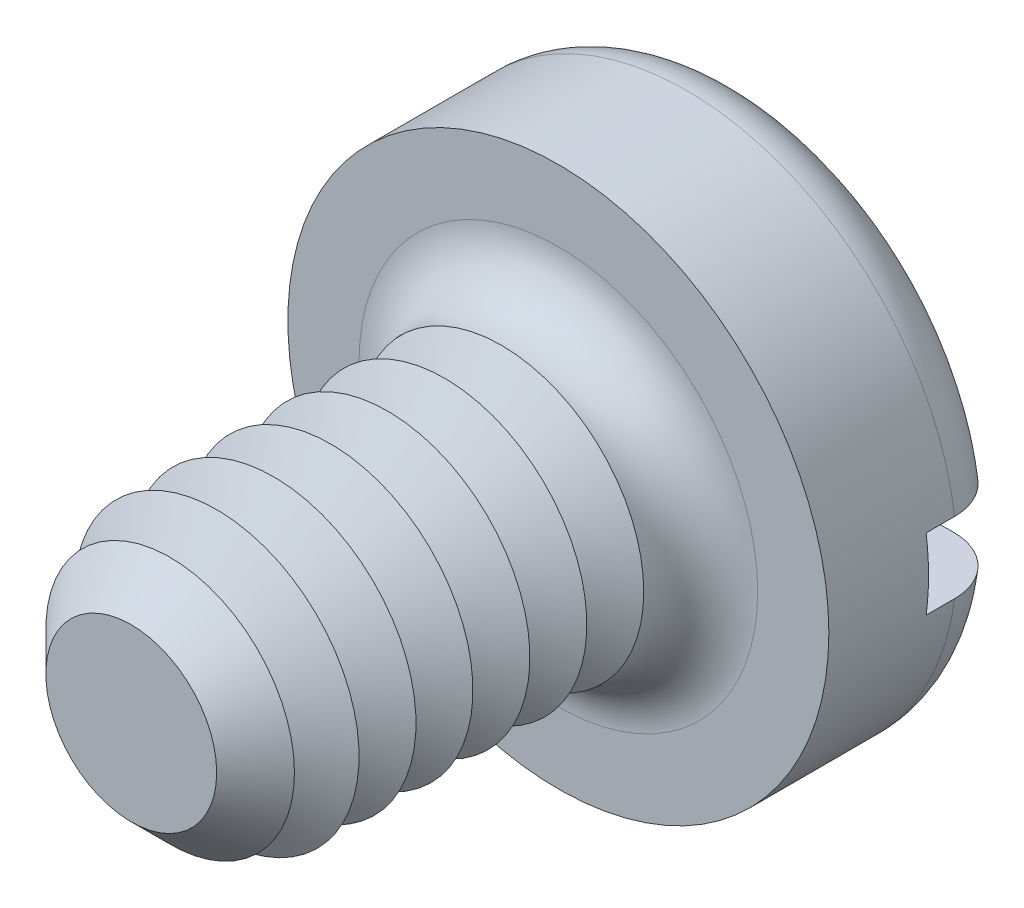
ISO-10303-21;
HEADER;
FILE_DESCRIPTION(('STEP AP214'),'2;1');
FILE_NAME('part.step','',(''),(''),'','','');
FILE_SCHEMA(('AUTOMOTIVE_DESIGN { 1 0 10303 214 1 1 1 1 }'));
ENDSEC;
DATA;
#1=APPLICATION_CONTEXT('core data for automotive mechanical design processes');
#2=APPLICATION_PROTOCOL_DEFINITION('international standard','automotive_design',2000,#1);
#3=PRODUCT_CONTEXT('',#1,'mechanical');
#4=PRODUCT('Part','Part','',(#3));
#5=PRODUCT_RELATED_PRODUCT_CATEGORY('part','',(#4));
#6=PRODUCT_DEFINITION_FORMATION('','',#4);
#7=PRODUCT_DEFINITION_CONTEXT('part definition',#1,'design');
#8=PRODUCT_DEFINITION('design','',#6,#7);
#9=PRODUCT_DEFINITION_SHAPE('','',#8);
#10=(LENGTH_UNIT() NAMED_UNIT(*) SI_UNIT(.MILLI.,.METRE.));
#11=(NAMED_UNIT(*) PLANE_ANGLE_UNIT() SI_UNIT($,.RADIAN.));
#12=(NAMED_UNIT(*) SI_UNIT($,.STERADIAN.) SOLID_ANGLE_UNIT());
#13=UNCERTAINTY_MEASURE_WITH_UNIT(LENGTH_MEASURE(1.E-05),#10,'distance_accuracy_value','');
#14=(GEOMETRIC_REPRESENTATION_CONTEXT(3) GLOBAL_UNCERTAINTY_ASSIGNED_CONTEXT((#13)) GLOBAL_UNIT_ASSIGNED_CONTEXT((#10,
#11,#12)) REPRESENTATION_CONTEXT('',''));
#15=CARTESIAN_POINT('',(0.,0.,0.));
#16=DIRECTION('',(0.,0.,1.));
#17=DIRECTION('',(1.,0.,0.));
#18=AXIS2_PLACEMENT_3D('',#15,#16,#17);
#19=CARTESIAN_POINT('',(0.,0.,-1.3));
#20=DIRECTION('',(0.,0.,1.));
#21=DIRECTION('',(1.,0.,0.));
#22=AXIS2_PLACEMENT_3D('',#19,#20,#21);
#23=PLANE('',#22);
#24=CARTESIAN_POINT('',(0.,0.,-1.3));
#25=DIRECTION('',(0.,0.,1.));
#26=DIRECTION('',(1.,0.,0.));
#27=AXIS2_PLACEMENT_3D('',#24,#25,#26);
#28=CIRCLE('',#27,1.5);
#29=CARTESIAN_POINT('',(-1.4790199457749,0.25,-1.3));
#30=VERTEX_POINT('',#29);
#31=CARTESIAN_POINT('',(1.4790199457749,0.25,-1.3));
#32=VERTEX_POINT('',#31);
#33=EDGE_CURVE('E116',#30,#32,#28,.F.);
#34=ORIENTED_EDGE('',*,*,#33,.T.);
#35=DIRECTION('',(1.,0.,0.));
#36=VECTOR('',#35,1.);
#37=CARTESIAN_POINT('',(-1.9,0.25,-1.3));
#38=LINE('',#37,#36);
#39=EDGE_CURVE('E111',#30,#32,#38,.T.);
#40=ORIENTED_EDGE('',*,*,#39,.F.);
#41=EDGE_LOOP('',(#34,#40));
#42=FACE_BOUND('',#41,.T.);
#43=ADVANCED_FACE('F39',(#42),#23,.F.);
#44=CARTESIAN_POINT('',(0.,0.,-0.9));
#45=DIRECTION('',(0.,0.,1.));
#46=DIRECTION('',(1.,0.,0.));
#47=AXIS2_PLACEMENT_3D('',#44,#45,#46);
#48=TOROIDAL_SURFACE('',#47,1.5,0.4);
#49=CARTESIAN_POINT('',(-1.8150392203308,0.25,-1.12284384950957));
#50=CARTESIAN_POINT('',(-1.80236980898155,0.25,-1.14155059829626));
#51=CARTESIAN_POINT('',(-1.78809920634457,0.25,-1.15919399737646));
#52=CARTESIAN_POINT('',(-1.75677844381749,0.25,-1.19184073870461));
#53=CARTESIAN_POINT('',(-1.73972468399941,0.25,-1.20684060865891));
#54=CARTESIAN_POINT('',(-1.70336024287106,0.25,-1.23375848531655));
#55=CARTESIAN_POINT('',(-1.68405164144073,0.25,-1.24567930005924));
#56=CARTESIAN_POINT('',(-1.64372549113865,0.25,-1.26613528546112));
#57=CARTESIAN_POINT('',(-1.6227083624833,0.25,-1.27467128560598));
#58=CARTESIAN_POINT('',(-1.57937988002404,0.25,-1.2881995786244));
#59=CARTESIAN_POINT('',(-1.55705957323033,0.25,-1.29316318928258));
#60=CARTESIAN_POINT('',(-1.51190394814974,0.25,-1.29931753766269));
#61=CARTESIAN_POINT('',(-1.48906857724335,0.25,-1.3005078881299));
#62=CARTESIAN_POINT('',(-1.4432641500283,0.25,-1.29909058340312));
#63=CARTESIAN_POINT('',(-1.42029638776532,0.25,-1.29644099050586));
#64=CARTESIAN_POINT('',(-1.37512297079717,0.25,-1.28735146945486));
#65=CARTESIAN_POINT('',(-1.3529173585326,0.25,-1.28091133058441));
#66=CARTESIAN_POINT('',(-1.30974098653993,0.25,-1.26436295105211));
#67=CARTESIAN_POINT('',(-1.28877978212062,0.25,-1.25422975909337));
#68=CARTESIAN_POINT('',(-1.24886205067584,0.25,-1.23057736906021));
#69=CARTESIAN_POINT('',(-1.22990554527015,0.25,-1.21705813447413));
#70=CARTESIAN_POINT('',(-1.19461911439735,0.25,-1.18704970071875));
#71=CARTESIAN_POINT('',(-1.17828051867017,0.25,-1.17057070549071));
#72=CARTESIAN_POINT('',(-1.14865897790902,0.25,-1.13506201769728));
#73=CARTESIAN_POINT('',(-1.13537576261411,0.25,-1.11603255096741));
#74=CARTESIAN_POINT('',(-1.11249827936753,0.25,-1.07630328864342));
#75=CARTESIAN_POINT('',(-1.10284494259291,0.25,-1.05563752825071));
#76=CARTESIAN_POINT('',(-1.08724024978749,0.25,-1.01295282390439));
#77=CARTESIAN_POINT('',(-1.08128829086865,0.25,-0.990934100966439));
#78=CARTESIAN_POINT('',(-1.07339124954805,0.25,-0.946722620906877));
#79=CARTESIAN_POINT('',(-1.07135558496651,0.25,-0.924546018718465));
#80=CARTESIAN_POINT('',(-1.07108722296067,0.25,-0.880170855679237));
#81=CARTESIAN_POINT('',(-1.07285419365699,0.25,-0.857972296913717));
#82=CARTESIAN_POINT('',(-1.0800838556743,0.25,-0.814463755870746));
#83=CARTESIAN_POINT('',(-1.08550159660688,0.25,-0.793146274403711));
#84=CARTESIAN_POINT('',(-1.09980522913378,0.25,-0.751709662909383));
#85=CARTESIAN_POINT('',(-1.10869126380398,0.25,-0.731590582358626));
#86=CARTESIAN_POINT('',(-1.12975121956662,0.25,-0.692901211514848));
#87=CARTESIAN_POINT('',(-1.14195627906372,0.25,-0.674347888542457));
#88=CARTESIAN_POINT('',(-1.1692428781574,0.25,-0.639494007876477));
#89=CARTESIAN_POINT('',(-1.18432473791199,0.25,-0.623193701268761));
#90=CARTESIAN_POINT('',(-1.21730350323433,0.25,-0.592916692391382));
#91=CARTESIAN_POINT('',(-1.23525650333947,0.25,-0.579001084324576));
#92=CARTESIAN_POINT('',(-1.27320799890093,0.25,-0.554314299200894));
#93=CARTESIAN_POINT('',(-1.2932067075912,0.25,-0.543543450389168));
#94=CARTESIAN_POINT('',(-1.33509120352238,0.25,-0.525253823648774));
#95=CARTESIAN_POINT('',(-1.35700545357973,0.25,-0.517800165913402));
#96=CARTESIAN_POINT('',(-1.401770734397,0.25,-0.506652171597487));
#97=CARTESIAN_POINT('',(-1.42462180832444,0.25,-0.502958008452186));
#98=CARTESIAN_POINT('',(-1.4707602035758,0.25,-0.499429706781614));
#99=CARTESIAN_POINT('',(-1.49404932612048,0.25,-0.499619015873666));
#100=CARTESIAN_POINT('',(-1.54026206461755,0.25,-0.50392615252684));
#101=CARTESIAN_POINT('',(-1.56318568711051,0.25,-0.508043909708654));
#102=CARTESIAN_POINT('',(-1.60788420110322,0.25,-0.520077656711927));
#103=CARTESIAN_POINT('',(-1.6296645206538,0.25,-0.527973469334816));
#104=CARTESIAN_POINT('',(-1.67156889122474,0.25,-0.547348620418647));
#105=CARTESIAN_POINT('',(-1.69169302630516,0.25,-0.558827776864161));
#106=CARTESIAN_POINT('',(-1.72948251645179,0.25,-0.584913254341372));
#107=CARTESIAN_POINT('',(-1.74717189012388,0.25,-0.599484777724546));
#108=CARTESIAN_POINT('',(-1.77981909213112,0.25,-0.63142070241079));
#109=CARTESIAN_POINT('',(-1.79477707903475,0.25,-0.648784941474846));
#110=CARTESIAN_POINT('',(-1.82136524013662,0.25,-0.685607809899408));
#111=CARTESIAN_POINT('',(-1.83303003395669,0.25,-0.705041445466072));
#112=CARTESIAN_POINT('',(-1.85289960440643,0.25,-0.745602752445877));
#113=CARTESIAN_POINT('',(-1.86110468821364,0.25,-0.76673027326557));
#114=CARTESIAN_POINT('',(-1.87375648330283,0.25,-0.809891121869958));
#115=CARTESIAN_POINT('',(-1.87823381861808,0.25,-0.831915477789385));
#116=CARTESIAN_POINT('',(-1.88341152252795,0.25,-0.87640983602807));
#117=CARTESIAN_POINT('',(-1.88411103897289,0.25,-0.898879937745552));
#118=CARTESIAN_POINT('',(-1.88171559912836,0.25,-0.943534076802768));
#119=CARTESIAN_POINT('',(-1.87863413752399,0.25,-0.965718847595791));
#120=CARTESIAN_POINT('',(-1.86879153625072,0.25,-1.00923650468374));
#121=CARTESIAN_POINT('',(-1.86203494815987,0.25,-1.03057040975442));
#122=CARTESIAN_POINT('',(-1.84837477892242,0.25,-1.06373797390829));
#123=CARTESIAN_POINT('',(-1.84255723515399,0.25,-1.07603047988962));
#124=CARTESIAN_POINT('',(-1.82969924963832,0.25,-1.09995814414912));
#125=CARTESIAN_POINT('',(-1.82265881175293,0.25,-1.11159330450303));
#126=CARTESIAN_POINT('',(-1.8150392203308,0.25,-1.12284384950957));
#127=B_SPLINE_CURVE_WITH_KNOTS('',3,(#49,#50,#51,#52,#53,#54,#55,#56,#57,#58,#59,#60,#61,#62,
#63,#64,#65,#66,#67,#68,#69,#70,#71,#72,#73,#74,#75,#76,#77,#78,#79,#80,#81,#82,#83,#84,#85,#86,
#87,#88,#89,#90,#91,#92,#93,#94,#95,#96,#97,#98,#99,#100,#101,#102,#103,#104,#105,#106,#107,
#108,#109,#110,#111,#112,#113,#114,#115,#116,#117,#118,#119,#120,#121,#122,#123,#124,#125,#126),
.UNSPECIFIED.,.T.,.F.,(4,2,2,2,2,2,2,2,2,2,2,2,2,2,2,2,2,2,2,2,2,2,2,2,2,2,2,2,2,2,2,2,2,2,2,2,
2,2,4),(0.,0.0677296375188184,0.135547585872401,0.203303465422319,0.27104273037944,
0.339319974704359,0.407604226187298,0.47663988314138,0.545679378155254,0.615194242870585,
0.684709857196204,0.753990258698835,0.82326452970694,0.891356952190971,0.959438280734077,
1.02592503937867,1.0924059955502,1.15808300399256,1.2237627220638,1.29008126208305,
1.35640718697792,1.4242376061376,1.49207510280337,1.5611911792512,1.63031044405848,
1.69984715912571,1.76938262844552,1.8385508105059,1.90771547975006,1.97613962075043,
2.04455978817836,2.11223135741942,2.17989691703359,2.24700094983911,2.31412011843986,
2.38100042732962,2.44779809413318,2.48853193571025,2.52926564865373),.UNSPECIFIED.);
#128=CARTESIAN_POINT('',(-1.88348082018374,0.25,-0.9));
#129=VERTEX_POINT('',#128);
#130=EDGE_CURVE('E232',#129,#30,#127,.T.);
#131=ORIENTED_EDGE('',*,*,#130,.F.);
#132=CARTESIAN_POINT('',(0.,0.,-0.9));
#133=DIRECTION('',(0.,0.,1.));
#134=DIRECTION('',(1.,0.,0.));
#135=AXIS2_PLACEMENT_3D('',#132,#133,#134);
#136=CIRCLE('',#135,1.9);
#137=CARTESIAN_POINT('',(1.88348082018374,0.25,-0.9));
#138=VERTEX_POINT('',#137);
#139=EDGE_CURVE('E124',#138,#129,#136,.T.);
#140=ORIENTED_EDGE('',*,*,#139,.F.);
#141=CARTESIAN_POINT('',(1.11362660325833,0.25,-1.07710243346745));
#142=CARTESIAN_POINT('',(1.12388366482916,0.25,-1.09736755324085));
#143=CARTESIAN_POINT('',(1.13589127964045,0.25,-1.11676768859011));
#144=CARTESIAN_POINT('',(1.16301945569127,0.25,-1.15328107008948));
#145=CARTESIAN_POINT('',(1.17814463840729,0.25,-1.17039085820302));
#146=CARTESIAN_POINT('',(1.21101661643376,0.25,-1.20182395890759));
#147=CARTESIAN_POINT('',(1.22875976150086,0.25,-1.21615108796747));
#148=CARTESIAN_POINT('',(1.26636392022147,0.25,-1.24166932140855));
#149=CARTESIAN_POINT('',(1.28622436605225,0.25,-1.25286126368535));
#150=CARTESIAN_POINT('',(1.32781377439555,0.25,-1.27196191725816));
#151=CARTESIAN_POINT('',(1.34956550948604,0.25,-1.27982107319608));
#152=CARTESIAN_POINT('',(1.39407620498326,0.25,-1.29180513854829));
#153=CARTESIAN_POINT('',(1.41683526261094,0.25,-1.29592968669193));
#154=CARTESIAN_POINT('',(1.46288034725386,0.25,-1.3003367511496));
#155=CARTESIAN_POINT('',(1.48616890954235,0.25,-1.30059287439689));
#156=CARTESIAN_POINT('',(1.53245605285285,0.25,-1.29717239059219));
#157=CARTESIAN_POINT('',(1.55545463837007,0.25,-1.29349584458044));
#158=CARTESIAN_POINT('',(1.60038828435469,0.25,-1.28232271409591));
#159=CARTESIAN_POINT('',(1.62232790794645,0.25,-1.27484449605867));
#160=CARTESIAN_POINT('',(1.66461970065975,0.25,-1.25627203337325));
#161=CARTESIAN_POINT('',(1.68497195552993,0.25,-1.24517798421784));
#162=CARTESIAN_POINT('',(1.72328060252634,0.25,-1.21981269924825));
#163=CARTESIAN_POINT('',(1.74126001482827,0.25,-1.2055762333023));
#164=CARTESIAN_POINT('',(1.77453973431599,0.25,-1.17425606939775));
#165=CARTESIAN_POINT('',(1.78984019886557,0.25,-1.1571725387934));
#166=CARTESIAN_POINT('',(1.81715014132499,0.25,-1.12084732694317));
#167=CARTESIAN_POINT('',(1.82919410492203,0.25,-1.10163156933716));
#168=CARTESIAN_POINT('',(1.84985315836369,0.25,-1.06143759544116));
#169=CARTESIAN_POINT('',(1.85846842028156,0.25,-1.04045946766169));
#170=CARTESIAN_POINT('',(1.87195437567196,0.25,-0.997526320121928));
#171=CARTESIAN_POINT('',(1.87685590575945,0.25,-0.975580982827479));
#172=CARTESIAN_POINT('',(1.88288741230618,0.25,-0.931178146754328));
#173=CARTESIAN_POINT('',(1.88401750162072,0.25,-0.908720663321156));
#174=CARTESIAN_POINT('',(1.88247598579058,0.25,-0.864033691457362));
#175=CARTESIAN_POINT('',(1.87982069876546,0.25,-0.841803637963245));
#176=CARTESIAN_POINT('',(1.87081646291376,0.25,-0.798104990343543));
#177=CARTESIAN_POINT('',(1.86446754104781,0.25,-0.776636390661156));
#178=CARTESIAN_POINT('',(1.84826063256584,0.25,-0.735060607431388));
#179=CARTESIAN_POINT('',(1.83840161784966,0.25,-0.714953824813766));
#180=CARTESIAN_POINT('',(1.81546327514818,0.25,-0.676670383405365));
#181=CARTESIAN_POINT('',(1.80238389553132,0.25,-0.658493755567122));
#182=CARTESIAN_POINT('',(1.77331327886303,0.25,-0.62448916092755));
#183=CARTESIAN_POINT('',(1.75730833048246,0.25,-0.608672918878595));
#184=CARTESIAN_POINT('',(1.72289038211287,0.25,-0.579924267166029));
#185=CARTESIAN_POINT('',(1.70447729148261,0.25,-0.566991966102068));
#186=CARTESIAN_POINT('',(1.66559643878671,0.25,-0.544254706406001));
#187=CARTESIAN_POINT('',(1.64511218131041,0.25,-0.53447796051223));
#188=CARTESIAN_POINT('',(1.60280554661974,0.25,-0.518459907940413));
#189=CARTESIAN_POINT('',(1.58098309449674,0.25,-0.512218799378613));
#190=CARTESIAN_POINT('',(1.53636184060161,0.25,-0.503375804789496));
#191=CARTESIAN_POINT('',(1.51355490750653,0.25,-0.500814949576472));
#192=CARTESIAN_POINT('',(1.46783245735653,0.25,-0.499516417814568));
#193=CARTESIAN_POINT('',(1.44491693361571,0.25,-0.500778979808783));
#194=CARTESIAN_POINT('',(1.39937748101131,0.25,-0.50711284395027));
#195=CARTESIAN_POINT('',(1.37675897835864,0.25,-0.512223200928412));
#196=CARTESIAN_POINT('',(1.33269286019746,0.25,-0.526151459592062));
#197=CARTESIAN_POINT('',(1.31124530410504,0.25,-0.534969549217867));
#198=CARTESIAN_POINT('',(1.27004097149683,0.25,-0.556118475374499));
#199=CARTESIAN_POINT('',(1.25029179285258,0.25,-0.568464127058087));
#200=CARTESIAN_POINT('',(1.21316554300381,0.25,-0.59631968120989));
#201=CARTESIAN_POINT('',(1.19578844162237,0.25,-0.611829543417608));
#202=CARTESIAN_POINT('',(1.16406059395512,0.25,-0.645459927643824));
#203=CARTESIAN_POINT('',(1.14968747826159,0.25,-0.663559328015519));
#204=CARTESIAN_POINT('',(1.12425968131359,0.25,-0.70195566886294));
#205=CARTESIAN_POINT('',(1.11320445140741,0.25,-0.722252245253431));
#206=CARTESIAN_POINT('',(1.09497726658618,0.25,-0.764020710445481));
#207=CARTESIAN_POINT('',(1.08772970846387,0.25,-0.785459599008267));
#208=CARTESIAN_POINT('',(1.07702618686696,0.25,-0.829269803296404));
#209=CARTESIAN_POINT('',(1.07357062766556,0.25,-0.851641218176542));
#210=CARTESIAN_POINT('',(1.07060826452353,0.25,-0.896160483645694));
#211=CARTESIAN_POINT('',(1.07101876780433,0.25,-0.918302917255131));
#212=CARTESIAN_POINT('',(1.07557730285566,0.25,-0.962179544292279));
#213=CARTESIAN_POINT('',(1.07972048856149,0.25,-0.983914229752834));
#214=CARTESIAN_POINT('',(1.08912066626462,0.25,-1.01754924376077));
#215=CARTESIAN_POINT('',(1.09320341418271,0.25,-1.02979035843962));
#216=CARTESIAN_POINT('',(1.10254493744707,0.25,-1.05381470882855));
#217=CARTESIAN_POINT('',(1.10780368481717,0.25,-1.06559795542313));
#218=CARTESIAN_POINT('',(1.11362660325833,0.25,-1.07710243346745));
#219=B_SPLINE_CURVE_WITH_KNOTS('',3,(#141,#142,#143,#144,#145,#146,#147,#148,#149,#150,#151,
#152,#153,#154,#155,#156,#157,#158,#159,#160,#161,#162,#163,#164,#165,#166,#167,#168,#169,#170,
#171,#172,#173,#174,#175,#176,#177,#178,#179,#180,#181,#182,#183,#184,#185,#186,#187,#188,#189,
#190,#191,#192,#193,#194,#195,#196,#197,#198,#199,#200,#201,#202,#203,#204,#205,#206,#207,#208,
#209,#210,#211,#212,#213,#214,#215,#216,#217,#218),.UNSPECIFIED.,.T.,.F.,(4,2,2,2,2,2,2,2,2,2,2,
2,2,2,2,2,2,2,2,2,2,2,2,2,2,2,2,2,2,2,2,2,2,2,2,2,2,2,4),(0.,0.0680907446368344,
0.136283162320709,0.204381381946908,0.272461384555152,0.341520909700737,0.410587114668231,
0.480124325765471,0.549660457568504,0.618863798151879,0.688063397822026,0.756532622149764,
0.824997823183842,0.892706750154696,0.960412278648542,1.02754926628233,1.09468424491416,
1.16153068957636,1.22837664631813,1.29524219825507,1.36210882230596,1.42929726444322,
1.49648823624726,1.56426429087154,1.63204414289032,1.70057395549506,1.76910804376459,
1.83834728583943,1.90759003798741,1.97712798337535,2.0466650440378,2.11566422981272,
2.18465199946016,2.25221259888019,2.3197804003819,2.38590630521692,2.45194648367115,
2.49060241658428,2.5292574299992),.UNSPECIFIED.);
#220=EDGE_CURVE('E234',#32,#138,#219,.T.);
#221=ORIENTED_EDGE('',*,*,#220,.F.);
#222=ORIENTED_EDGE('',*,*,#33,.F.);
#223=EDGE_LOOP('',(#131,#140,#221,#222));
#224=FACE_BOUND('',#223,.T.);
#225=ADVANCED_FACE('F216',(#224),#48,.T.);
#226=CARTESIAN_POINT('',(0.,0.,-1.3));
#227=DIRECTION('',(0.,0.,1.));
#228=DIRECTION('',(1.,0.,0.));
#229=AXIS2_PLACEMENT_3D('',#226,#227,#228);
#230=CYLINDRICAL_SURFACE('',#229,1.9);
#231=DIRECTION('',(0.,0.,1.));
#232=VECTOR('',#231,1.);
#233=CARTESIAN_POINT('',(1.88348082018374,0.25,-1.3));
#234=LINE('',#233,#232);
#235=CARTESIAN_POINT('',(1.88348082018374,0.25,-0.7));
#236=VERTEX_POINT('',#235);
#237=EDGE_CURVE('E248',#138,#236,#234,.T.);
#238=ORIENTED_EDGE('',*,*,#237,.F.);
#239=ORIENTED_EDGE('',*,*,#139,.T.);
#240=DIRECTION('',(0.,0.,1.));
#241=VECTOR('',#240,1.);
#242=CARTESIAN_POINT('',(-1.88348082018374,0.25,-1.3));
#243=LINE('',#242,#241);
#244=CARTESIAN_POINT('',(-1.88348082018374,0.25,-0.7));
#245=VERTEX_POINT('',#244);
#246=EDGE_CURVE('E63',#245,#129,#243,.F.);
#247=ORIENTED_EDGE('',*,*,#246,.F.);
#248=CARTESIAN_POINT('',(0.,0.,-0.7));
#249=DIRECTION('',(0.,0.,-1.));
#250=DIRECTION('',(-1.,0.,0.));
#251=AXIS2_PLACEMENT_3D('',#248,#249,#250);
#252=CIRCLE('',#251,1.9);
#253=CARTESIAN_POINT('',(-1.88348082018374,-0.25,-0.7));
#254=VERTEX_POINT('',#253);
#255=EDGE_CURVE('E43',#245,#254,#252,.F.);
#256=ORIENTED_EDGE('',*,*,#255,.T.);
#257=DIRECTION('',(0.,0.,1.));
#258=VECTOR('',#257,1.);
#259=CARTESIAN_POINT('',(-1.88348082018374,-0.25,-1.3));
#260=LINE('',#259,#258);
#261=CARTESIAN_POINT('',(-1.88348082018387,-0.25,-0.899999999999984));
#262=VERTEX_POINT('',#261);
#263=EDGE_CURVE('E245',#262,#254,#260,.T.);
#264=ORIENTED_EDGE('',*,*,#263,.F.);
#265=CARTESIAN_POINT('',(1.88348082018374,-0.25,-0.9));
#266=VERTEX_POINT('',#265);
#267=EDGE_CURVE('E126',#262,#266,#136,.T.);
#268=ORIENTED_EDGE('',*,*,#267,.T.);
#269=DIRECTION('',(0.,0.,1.));
#270=VECTOR('',#269,1.);
#271=CARTESIAN_POINT('',(1.88348082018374,-0.25,-1.3));
#272=LINE('',#271,#270);
#273=CARTESIAN_POINT('',(1.88348082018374,-0.25,-0.7));
#274=VERTEX_POINT('',#273);
#275=EDGE_CURVE('E55',#274,#266,#272,.F.);
#276=ORIENTED_EDGE('',*,*,#275,.F.);
#277=EDGE_CURVE('E11',#274,#236,#252,.F.);
#278=ORIENTED_EDGE('',*,*,#277,.T.);
#279=EDGE_LOOP('',(#238,#239,#247,#256,#264,#268,#276,#278));
#280=FACE_BOUND('',#279,.T.);
#281=CARTESIAN_POINT('',(0.,0.,0.));
#282=DIRECTION('',(0.,0.,1.));
#283=DIRECTION('',(1.,0.,0.));
#284=AXIS2_PLACEMENT_3D('',#281,#282,#283);
#285=CIRCLE('',#284,1.9);
#286=CARTESIAN_POINT('',(1.9,0.,0.));
#287=VERTEX_POINT('',#286);
#288=EDGE_CURVE('E251',#287,#287,#285,.T.);
#289=ORIENTED_EDGE('',*,*,#288,.F.);
#290=EDGE_LOOP('',(#289));
#291=FACE_BOUND('',#290,.T.);
#292=ADVANCED_FACE('F212',(#280,#291),#230,.T.);
#293=CARTESIAN_POINT('',(1.4790199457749,-0.25,-1.3));
#294=VERTEX_POINT('',#293);
#295=CARTESIAN_POINT('',(-1.4790199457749,-0.25,-1.3));
#296=VERTEX_POINT('',#295);
#297=EDGE_CURVE('E109',#294,#296,#28,.F.);
#298=ORIENTED_EDGE('',*,*,#297,.T.);
#299=DIRECTION('',(-1.,0.,0.));
#300=VECTOR('',#299,1.);
#301=CARTESIAN_POINT('',(-1.9,-0.25,-1.3));
#302=LINE('',#301,#300);
#303=EDGE_CURVE('E96',#294,#296,#302,.T.);
#304=ORIENTED_EDGE('',*,*,#303,.F.);
#305=EDGE_LOOP('',(#298,#304));
#306=FACE_BOUND('',#305,.T.);
#307=ADVANCED_FACE('F108',(#306),#23,.F.);
#308=CARTESIAN_POINT('',(0.,0.,0.));
#309=DIRECTION('',(0.,0.,1.));
#310=DIRECTION('',(1.,0.,0.));
#311=AXIS2_PLACEMENT_3D('',#308,#309,#310);
#312=PLANE('',#311);
#313=CARTESIAN_POINT('',(0.,0.,0.));
#314=DIRECTION('',(0.,0.,1.));
#315=DIRECTION('',(1.,0.,0.));
#316=AXIS2_PLACEMENT_3D('',#313,#314,#315);
#317=CIRCLE('',#316,1.4);
#318=CARTESIAN_POINT('',(1.4,0.,0.));
#319=VERTEX_POINT('',#318);
#320=EDGE_CURVE('E115',#319,#319,#317,.F.);
#321=ORIENTED_EDGE('',*,*,#320,.T.);
#322=EDGE_LOOP('',(#321));
#323=FACE_BOUND('',#322,.T.);
#324=ORIENTED_EDGE('',*,*,#288,.T.);
#325=EDGE_LOOP('',(#324));
#326=FACE_BOUND('',#325,.T.);
#327=ADVANCED_FACE('F211',(#323,#326),#312,.T.);
#328=CARTESIAN_POINT('',(-1.8150392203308,-0.25,-1.12284384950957));
#329=CARTESIAN_POINT('',(-1.82756185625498,-0.25,-1.10435021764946));
#330=CARTESIAN_POINT('',(-1.83853807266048,-0.25,-1.08479072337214));
#331=CARTESIAN_POINT('',(-1.85706233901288,-0.25,-1.04409188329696));
#332=CARTESIAN_POINT('',(-1.86460655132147,-0.25,-1.02295079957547));
#333=CARTESIAN_POINT('',(-1.87603074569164,-0.25,-0.979704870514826));
#334=CARTESIAN_POINT('',(-1.87991177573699,-0.25,-0.957600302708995));
#335=CARTESIAN_POINT('',(-1.88389586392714,-0.25,-0.913058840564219));
#336=CARTESIAN_POINT('',(-1.88399981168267,-0.25,-0.890622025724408));
#337=CARTESIAN_POINT('',(-1.88043374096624,-0.25,-0.846104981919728));
#338=CARTESIAN_POINT('',(-1.87677281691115,-0.25,-0.824024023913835));
#339=CARTESIAN_POINT('',(-1.86579880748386,-0.25,-0.780788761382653));
#340=CARTESIAN_POINT('',(-1.85848560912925,-0.25,-0.759634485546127));
#341=CARTESIAN_POINT('',(-1.8404137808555,-0.25,-0.718830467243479));
#342=CARTESIAN_POINT('',(-1.82965205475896,-0.25,-0.699182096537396));
#343=CARTESIAN_POINT('',(-1.80499939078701,-0.25,-0.661958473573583));
#344=CARTESIAN_POINT('',(-1.7911083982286,-0.25,-0.644383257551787));
#345=CARTESIAN_POINT('',(-1.76051564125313,-0.25,-0.611699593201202));
#346=CARTESIAN_POINT('',(-1.74379913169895,-0.25,-0.596604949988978));
#347=CARTESIAN_POINT('',(-1.70808901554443,-0.25,-0.569406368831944));
#348=CARTESIAN_POINT('',(-1.68909532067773,-0.25,-0.557302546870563));
#349=CARTESIAN_POINT('',(-1.64918615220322,-0.25,-0.536307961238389));
#350=CARTESIAN_POINT('',(-1.62825469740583,-0.25,-0.527447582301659));
#351=CARTESIAN_POINT('',(-1.58521203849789,-0.25,-0.513323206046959));
#352=CARTESIAN_POINT('',(-1.5631007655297,-0.25,-0.508059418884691));
#353=CARTESIAN_POINT('',(-1.51806209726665,-0.25,-0.501215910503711));
#354=CARTESIAN_POINT('',(-1.4951283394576,-0.25,-0.499678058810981));
#355=CARTESIAN_POINT('',(-1.4493239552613,-0.25,-0.500434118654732));
#356=CARTESIAN_POINT('',(-1.4264533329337,-0.25,-0.502728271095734));
#357=CARTESIAN_POINT('',(-1.38118643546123,-0.25,-0.511115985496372));
#358=CARTESIAN_POINT('',(-1.35879703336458,-0.25,-0.51724667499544));
#359=CARTESIAN_POINT('',(-1.31535851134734,-0.25,-0.533167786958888));
#360=CARTESIAN_POINT('',(-1.29430945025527,-0.25,-0.542958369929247));
#361=CARTESIAN_POINT('',(-1.25409242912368,-0.25,-0.565968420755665));
#362=CARTESIAN_POINT('',(-1.23493023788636,-0.25,-0.579197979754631));
#363=CARTESIAN_POINT('',(-1.19912477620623,-0.25,-0.608715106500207));
#364=CARTESIAN_POINT('',(-1.18248143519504,-0.25,-0.625002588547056));
#365=CARTESIAN_POINT('',(-1.15237533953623,-0.25,-0.660018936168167));
#366=CARTESIAN_POINT('',(-1.13888343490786,-0.25,-0.678722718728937));
#367=CARTESIAN_POINT('',(-1.115312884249,-0.25,-0.718170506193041));
#368=CARTESIAN_POINT('',(-1.10523377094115,-0.25,-0.738914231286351));
#369=CARTESIAN_POINT('',(-1.08901310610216,-0.25,-0.781372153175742));
#370=CARTESIAN_POINT('',(-1.08279080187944,-0.25,-0.803055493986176));
#371=CARTESIAN_POINT('',(-1.07416105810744,-0.25,-0.847167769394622));
#372=CARTESIAN_POINT('',(-1.07175306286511,-0.25,-0.869596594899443));
#373=CARTESIAN_POINT('',(-1.07084656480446,-0.25,-0.914070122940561));
#374=CARTESIAN_POINT('',(-1.07226874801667,-0.25,-0.936113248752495));
#375=CARTESIAN_POINT('',(-1.07880428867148,-0.25,-0.979644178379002));
#376=CARTESIAN_POINT('',(-1.08391755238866,-0.25,-1.00113199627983));
#377=CARTESIAN_POINT('',(-1.09764616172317,-0.25,-1.04290115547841));
#378=CARTESIAN_POINT('',(-1.10625346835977,-0.25,-1.06318514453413));
#379=CARTESIAN_POINT('',(-1.12669365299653,-0.25,-1.10205584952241));
#380=CARTESIAN_POINT('',(-1.13852679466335,-0.25,-1.12064242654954));
#381=CARTESIAN_POINT('',(-1.16529672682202,-0.25,-1.15594801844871));
#382=CARTESIAN_POINT('',(-1.18028464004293,-0.25,-1.17262825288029));
#383=CARTESIAN_POINT('',(-1.21279183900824,-0.25,-1.20330600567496));
#384=CARTESIAN_POINT('',(-1.23031142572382,-0.25,-1.21730320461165));
#385=CARTESIAN_POINT('',(-1.26781695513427,-0.25,-1.24254670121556));
#386=CARTESIAN_POINT('',(-1.28784999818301,-0.25,-1.25372305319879));
#387=CARTESIAN_POINT('',(-1.3294899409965,-0.25,-1.27260611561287));
#388=CARTESIAN_POINT('',(-1.35109697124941,-0.25,-1.28031253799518));
#389=CARTESIAN_POINT('',(-1.39558575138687,-0.25,-1.29212626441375));
#390=CARTESIAN_POINT('',(-1.4184807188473,-0.25,-1.29618386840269));
#391=CARTESIAN_POINT('',(-1.4646266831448,-0.25,-1.30039947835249));
#392=CARTESIAN_POINT('',(-1.48787767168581,-0.25,-1.30055757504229));
#393=CARTESIAN_POINT('',(-1.53407883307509,-0.25,-1.29695468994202));
#394=CARTESIAN_POINT('',(-1.55702895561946,-0.25,-1.29319306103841));
#395=CARTESIAN_POINT('',(-1.60196718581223,-0.25,-1.28183520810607));
#396=CARTESIAN_POINT('',(-1.62395508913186,-0.25,-1.27423817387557));
#397=CARTESIAN_POINT('',(-1.66614393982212,-0.25,-1.25548646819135));
#398=CARTESIAN_POINT('',(-1.68635782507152,-0.25,-1.24436087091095));
#399=CARTESIAN_POINT('',(-1.72458266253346,-0.25,-1.21884344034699));
#400=CARTESIAN_POINT('',(-1.74259637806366,-0.25,-1.20445577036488));
#401=CARTESIAN_POINT('',(-1.76968989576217,-0.25,-1.1787247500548));
#402=CARTESIAN_POINT('',(-1.77959984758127,-0.25,-1.1682407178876));
#403=CARTESIAN_POINT('',(-1.79823423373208,-0.25,-1.14626700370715));
#404=CARTESIAN_POINT('',(-1.80695867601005,-0.25,-1.1347773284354));
#405=CARTESIAN_POINT('',(-1.8150392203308,-0.25,-1.12284384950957));
#406=B_SPLINE_CURVE_WITH_KNOTS('',3,(#328,#329,#330,#331,#332,#333,#334,#335,#336,#337,#338,
#339,#340,#341,#342,#343,#344,#345,#346,#347,#348,#349,#350,#351,#352,#353,#354,#355,#356,#357,
#358,#359,#360,#361,#362,#363,#364,#365,#366,#367,#368,#369,#370,#371,#372,#373,#374,#375,#376,
#377,#378,#379,#380,#381,#382,#383,#384,#385,#386,#387,#388,#389,#390,#391,#392,#393,#394,#395,
#396,#397,#398,#399,#400,#401,#402,#403,#404,#405),.UNSPECIFIED.,.T.,.F.,(4,2,2,2,2,2,2,2,2,2,2,
2,2,2,2,2,2,2,2,2,2,2,2,2,2,2,2,2,2,2,2,2,2,2,2,2,2,2,4),(0.,0.0669512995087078,
0.133977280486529,0.200984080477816,0.267975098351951,0.334804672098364,0.401636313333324,
0.468528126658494,0.535421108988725,0.602674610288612,0.669930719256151,0.737801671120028,
0.805676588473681,0.87431077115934,0.942949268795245,1.0122625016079,1.08157877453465,
1.15110078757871,1.22062085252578,1.28946987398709,1.35830946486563,1.42565417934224,
1.49298908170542,1.55894041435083,1.62489007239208,1.69068884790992,1.75649300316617,
1.82345932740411,1.89043361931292,1.95893391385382,2.02743989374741,2.09686543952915,
2.16628937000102,2.23572476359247,2.3051748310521,2.3740669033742,2.44287154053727,
2.48607383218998,2.52927583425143),.UNSPECIFIED.);
#407=EDGE_CURVE('E103',#296,#262,#406,.T.);
#408=ORIENTED_EDGE('',*,*,#407,.F.);
#409=ORIENTED_EDGE('',*,*,#297,.F.);
#410=CARTESIAN_POINT('',(1.11362660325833,-0.25,-1.07710243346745));
#411=CARTESIAN_POINT('',(1.10368387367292,-0.25,-1.05745397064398));
#412=CARTESIAN_POINT('',(1.09537204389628,-0.25,-1.0369644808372));
#413=CARTESIAN_POINT('',(1.08229212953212,-0.25,-0.994867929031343));
#414=CARTESIAN_POINT('',(1.07752732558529,-0.25,-0.973259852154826));
#415=CARTESIAN_POINT('',(1.07171197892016,-0.25,-0.929545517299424));
#416=CARTESIAN_POINT('',(1.07066166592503,-0.25,-0.907439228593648));
#417=CARTESIAN_POINT('',(1.07231382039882,-0.25,-0.863372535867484));
#418=CARTESIAN_POINT('',(1.07501551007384,-0.25,-0.841412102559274));
#419=CARTESIAN_POINT('',(1.08404966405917,-0.25,-0.798386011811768));
#420=CARTESIAN_POINT('',(1.09036099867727,-0.25,-0.777315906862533));
#421=CARTESIAN_POINT('',(1.10638973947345,-0.25,-0.736514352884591));
#422=CARTESIAN_POINT('',(1.11610743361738,-0.25,-0.716783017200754));
#423=CARTESIAN_POINT('',(1.13878208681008,-0.25,-0.678952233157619));
#424=CARTESIAN_POINT('',(1.15177705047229,-0.25,-0.660875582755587));
#425=CARTESIAN_POINT('',(1.18055347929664,-0.25,-0.62709692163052));
#426=CARTESIAN_POINT('',(1.19633525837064,-0.25,-0.611395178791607));
#427=CARTESIAN_POINT('',(1.23062926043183,-0.25,-0.582430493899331));
#428=CARTESIAN_POINT('',(1.24919608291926,-0.25,-0.569232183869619));
#429=CARTESIAN_POINT('',(1.28825118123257,-0.25,-0.546076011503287));
#430=CARTESIAN_POINT('',(1.30873964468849,-0.25,-0.536118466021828));
#431=CARTESIAN_POINT('',(1.35144534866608,-0.25,-0.519560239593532));
#432=CARTESIAN_POINT('',(1.3736865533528,-0.25,-0.513021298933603));
#433=CARTESIAN_POINT('',(1.41894945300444,-0.25,-0.503751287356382));
#434=CARTESIAN_POINT('',(1.44197117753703,-0.25,-0.50102036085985));
#435=CARTESIAN_POINT('',(1.48824913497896,-0.25,-0.499449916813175));
#436=CARTESIAN_POINT('',(1.5115059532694,-0.25,-0.500627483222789));
#437=CARTESIAN_POINT('',(1.55748678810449,-0.25,-0.506895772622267));
#438=CARTESIAN_POINT('',(1.58021081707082,-0.25,-0.511986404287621));
#439=CARTESIAN_POINT('',(1.6243247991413,-0.25,-0.525910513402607));
#440=CARTESIAN_POINT('',(1.64572225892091,-0.25,-0.534720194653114));
#441=CARTESIAN_POINT('',(1.68671060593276,-0.25,-0.555845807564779));
#442=CARTESIAN_POINT('',(1.70630159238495,-0.25,-0.568161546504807));
#443=CARTESIAN_POINT('',(1.74289060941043,-0.25,-0.595805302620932));
#444=CARTESIAN_POINT('',(1.75991474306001,-0.25,-0.611098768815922));
#445=CARTESIAN_POINT('',(1.79111916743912,-0.25,-0.644354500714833));
#446=CARTESIAN_POINT('',(1.80529962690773,-0.25,-0.662316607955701));
#447=CARTESIAN_POINT('',(1.83025525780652,-0.25,-0.700191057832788));
#448=CARTESIAN_POINT('',(1.84106535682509,-0.25,-0.720080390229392));
#449=CARTESIAN_POINT('',(1.8591630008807,-0.25,-0.761401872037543));
#450=CARTESIAN_POINT('',(1.86645070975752,-0.25,-0.782833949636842));
#451=CARTESIAN_POINT('',(1.87724305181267,-0.25,-0.826454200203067));
#452=CARTESIAN_POINT('',(1.88077646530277,-0.25,-0.848635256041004));
#453=CARTESIAN_POINT('',(1.88405487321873,-0.25,-0.89327539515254));
#454=CARTESIAN_POINT('',(1.88379996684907,-0.25,-0.915734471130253));
#455=CARTESIAN_POINT('',(1.87951702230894,-0.25,-0.96021054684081));
#456=CARTESIAN_POINT('',(1.87550211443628,-0.25,-0.982228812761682));
#457=CARTESIAN_POINT('',(1.86383665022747,-0.25,-1.0252797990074));
#458=CARTESIAN_POINT('',(1.85618610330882,-0.25,-1.04631252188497));
#459=CARTESIAN_POINT('',(1.83746332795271,-0.25,-1.08682395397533));
#460=CARTESIAN_POINT('',(1.82638722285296,-0.25,-1.10630087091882));
#461=CARTESIAN_POINT('',(1.80113946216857,-0.25,-1.14313202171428));
#462=CARTESIAN_POINT('',(1.78696774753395,-0.25,-1.1604862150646));
#463=CARTESIAN_POINT('',(1.75585044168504,-0.25,-1.19268694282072));
#464=CARTESIAN_POINT('',(1.73888979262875,-0.25,-1.20751892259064));
#465=CARTESIAN_POINT('',(1.7027387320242,-0.25,-1.23415579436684));
#466=CARTESIAN_POINT('',(1.68354822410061,-0.25,-1.24596055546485));
#467=CARTESIAN_POINT('',(1.64329341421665,-0.25,-1.26632784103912));
#468=CARTESIAN_POINT('',(1.62221336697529,-0.25,-1.27485924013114));
#469=CARTESIAN_POINT('',(1.5789301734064,-0.25,-1.28830571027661));
#470=CARTESIAN_POINT('',(1.55672695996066,-0.25,-1.29322056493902));
#471=CARTESIAN_POINT('',(1.5115614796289,-0.25,-1.29935191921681));
#472=CARTESIAN_POINT('',(1.4885934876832,-0.25,-1.30052625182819));
#473=CARTESIAN_POINT('',(1.44278240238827,-0.25,-1.2990417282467));
#474=CARTESIAN_POINT('',(1.41993931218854,-0.25,-1.29638277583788));
#475=CARTESIAN_POINT('',(1.37479511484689,-0.25,-1.28727159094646));
#476=CARTESIAN_POINT('',(1.35250125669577,-0.25,-1.2807834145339));
#477=CARTESIAN_POINT('',(1.30930729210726,-0.25,-1.2641644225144));
#478=CARTESIAN_POINT('',(1.2884075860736,-0.25,-1.25403256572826));
#479=CARTESIAN_POINT('',(1.24854853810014,-0.25,-1.23036781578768));
#480=CARTESIAN_POINT('',(1.22959511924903,-0.25,-1.21682495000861));
#481=CARTESIAN_POINT('',(1.19427766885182,-0.25,-1.18672803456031));
#482=CARTESIAN_POINT('',(1.17791048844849,-0.25,-1.170177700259));
#483=CARTESIAN_POINT('',(1.15346856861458,-0.25,-1.14079355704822));
#484=CARTESIAN_POINT('',(1.14449891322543,-0.25,-1.12869247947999));
#485=CARTESIAN_POINT('',(1.12797460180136,-0.25,-1.10355927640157));
#486=CARTESIAN_POINT('',(1.1204199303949,-0.25,-1.09052716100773));
#487=CARTESIAN_POINT('',(1.11362660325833,-0.25,-1.07710243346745));
#488=B_SPLINE_CURVE_WITH_KNOTS('',3,(#410,#411,#412,#413,#414,#415,#416,#417,#418,#419,#420,
#421,#422,#423,#424,#425,#426,#427,#428,#429,#430,#431,#432,#433,#434,#435,#436,#437,#438,#439,
#440,#441,#442,#443,#444,#445,#446,#447,#448,#449,#450,#451,#452,#453,#454,#455,#456,#457,#458,
#459,#460,#461,#462,#463,#464,#465,#466,#467,#468,#469,#470,#471,#472,#473,#474,#475,#476,#477,
#478,#479,#480,#481,#482,#483,#484,#485,#486,#487),.UNSPECIFIED.,.T.,.F.,(4,2,2,2,2,2,2,2,2,2,2,
2,2,2,2,2,2,2,2,2,2,2,2,2,2,2,2,2,2,2,2,2,2,2,2,2,2,2,4),(0.,0.0660089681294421,
0.132078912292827,0.198152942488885,0.26421327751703,0.329890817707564,0.395573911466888,
0.462056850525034,0.528547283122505,0.596571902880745,0.664603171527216,0.733823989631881,
0.803047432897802,0.872573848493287,0.94209864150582,1.01118516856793,1.08026789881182,
1.14859228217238,1.21691261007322,1.28449938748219,1.35208302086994,1.41914473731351,
1.48620469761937,1.55303134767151,1.61985782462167,1.68676020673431,1.75366386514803,
1.82094137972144,1.88822180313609,1.95612699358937,2.0240362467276,2.09270838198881,
2.16138224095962,2.23071121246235,2.30006001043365,2.36961396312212,2.4390825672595,
2.48418340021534,2.52928374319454),.UNSPECIFIED.);
#489=EDGE_CURVE('E92',#266,#294,#488,.T.);
#490=ORIENTED_EDGE('',*,*,#489,.F.);
#491=ORIENTED_EDGE('',*,*,#267,.F.);
#492=EDGE_LOOP('',(#408,#409,#490,#491));
#493=FACE_BOUND('',#492,.T.);
#494=ADVANCED_FACE('F113',(#493),#48,.T.);
#495=CARTESIAN_POINT('',(0.,0.,0.4));
#496=DIRECTION('',(0.,0.,1.));
#497=DIRECTION('',(1.,0.,0.));
#498=AXIS2_PLACEMENT_3D('',#495,#496,#497);
#499=TOROIDAL_SURFACE('',#498,1.4,0.4);
#500=ORIENTED_EDGE('',*,*,#320,.F.);
#501=EDGE_LOOP('',(#500));
#502=FACE_BOUND('',#501,.T.);
#503=CARTESIAN_POINT('',(0.,0.,0.4));
#504=DIRECTION('',(0.,0.,-1.));
#505=DIRECTION('',(-1.,0.,0.));
#506=AXIS2_PLACEMENT_3D('',#503,#504,#505);
#507=CIRCLE('',#506,1.);
#508=CARTESIAN_POINT('',(-1.,0.,0.4));
#509=VERTEX_POINT('',#508);
#510=EDGE_CURVE('E255',#509,#509,#507,.T.);
#511=ORIENTED_EDGE('',*,*,#510,.T.);
#512=EDGE_LOOP('',(#511));
#513=FACE_BOUND('',#512,.T.);
#514=ADVANCED_FACE('F204',(#502,#513),#499,.F.);
#515=CARTESIAN_POINT('',(0.,0.,0.6));
#516=DIRECTION('',(0.,0.,-1.));
#517=DIRECTION('',(-1.,0.,0.));
#518=AXIS2_PLACEMENT_3D('',#515,#516,#517);
#519=CONICAL_SURFACE('',#518,0.653589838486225,1.0471975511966);
#520=ORIENTED_EDGE('',*,*,#510,.F.);
#521=EDGE_LOOP('',(#520));
#522=FACE_BOUND('',#521,.T.);
#523=CARTESIAN_POINT('',(0.,0.,0.6));
#524=DIRECTION('',(0.,0.,-1.));
#525=DIRECTION('',(-1.,0.,0.));
#526=AXIS2_PLACEMENT_3D('',#523,#524,#525);
#527=CIRCLE('',#526,0.653589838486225);
#528=CARTESIAN_POINT('',(-0.653589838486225,0.,0.6));
#529=VERTEX_POINT('',#528);
#530=EDGE_CURVE('E261',#529,#529,#527,.T.);
#531=ORIENTED_EDGE('',*,*,#530,.T.);
#532=EDGE_LOOP('',(#531));
#533=FACE_BOUND('',#532,.T.);
#534=ADVANCED_FACE('F200',(#522,#533),#519,.T.);
#535=CARTESIAN_POINT('',(0.,0.,0.8));
#536=DIRECTION('',(0.,0.,1.));
#537=DIRECTION('',(1.,0.,0.));
#538=AXIS2_PLACEMENT_3D('',#535,#536,#537);
#539=CONICAL_SURFACE('',#538,1.,1.0471975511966);
#540=ORIENTED_EDGE('',*,*,#530,.F.);
#541=EDGE_LOOP('',(#540));
#542=FACE_BOUND('',#541,.T.);
#543=CARTESIAN_POINT('',(0.,0.,0.8));
#544=DIRECTION('',(0.,0.,-1.));
#545=DIRECTION('',(-1.,0.,0.));
#546=AXIS2_PLACEMENT_3D('',#543,#544,#545);
#547=CIRCLE('',#546,1.);
#548=CARTESIAN_POINT('',(-1.,0.,0.8));
#549=VERTEX_POINT('',#548);
#550=EDGE_CURVE('E267',#549,#549,#547,.T.);
#551=ORIENTED_EDGE('',*,*,#550,.T.);
#552=EDGE_LOOP('',(#551));
#553=FACE_BOUND('',#552,.T.);
#554=ADVANCED_FACE('F196',(#542,#553),#539,.T.);
#555=CARTESIAN_POINT('',(0.,0.,1.));
#556=DIRECTION('',(0.,0.,-1.));
#557=DIRECTION('',(-1.,0.,0.));
#558=AXIS2_PLACEMENT_3D('',#555,#556,#557);
#559=CONICAL_SURFACE('',#558,0.653589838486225,1.0471975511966);
#560=ORIENTED_EDGE('',*,*,#550,.F.);
#561=EDGE_LOOP('',(#560));
#562=FACE_BOUND('',#561,.T.);
#563=CARTESIAN_POINT('',(0.,0.,1.));
#564=DIRECTION('',(0.,0.,-1.));
#565=DIRECTION('',(-1.,0.,0.));
#566=AXIS2_PLACEMENT_3D('',#563,#564,#565);
#567=CIRCLE('',#566,0.653589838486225);
#568=CARTESIAN_POINT('',(-0.653589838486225,0.,1.));
#569=VERTEX_POINT('',#568);
#570=EDGE_CURVE('E271',#569,#569,#567,.T.);
#571=ORIENTED_EDGE('',*,*,#570,.T.);
#572=EDGE_LOOP('',(#571));
#573=FACE_BOUND('',#572,.T.);
#574=ADVANCED_FACE('F192',(#562,#573),#559,.T.);
#575=CARTESIAN_POINT('',(0.,0.,1.2));
#576=DIRECTION('',(0.,0.,1.));
#577=DIRECTION('',(1.,0.,0.));
#578=AXIS2_PLACEMENT_3D('',#575,#576,#577);
#579=CONICAL_SURFACE('',#578,1.,1.0471975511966);
#580=ORIENTED_EDGE('',*,*,#570,.F.);
#581=EDGE_LOOP('',(#580));
#582=FACE_BOUND('',#581,.T.);
#583=CARTESIAN_POINT('',(0.,0.,1.2));
#584=DIRECTION('',(0.,0.,-1.));
#585=DIRECTION('',(-1.,0.,0.));
#586=AXIS2_PLACEMENT_3D('',#583,#584,#585);
#587=CIRCLE('',#586,1.);
#588=CARTESIAN_POINT('',(-1.,0.,1.2));
#589=VERTEX_POINT('',#588);
#590=EDGE_CURVE('E275',#589,#589,#587,.T.);
#591=ORIENTED_EDGE('',*,*,#590,.T.);
#592=EDGE_LOOP('',(#591));
#593=FACE_BOUND('',#592,.T.);
#594=ADVANCED_FACE('F188',(#582,#593),#579,.T.);
#595=CARTESIAN_POINT('',(0.,0.,1.4));
#596=DIRECTION('',(0.,0.,-1.));
#597=DIRECTION('',(-1.,0.,0.));
#598=AXIS2_PLACEMENT_3D('',#595,#596,#597);
#599=CONICAL_SURFACE('',#598,0.653589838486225,1.0471975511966);
#600=ORIENTED_EDGE('',*,*,#590,.F.);
#601=EDGE_LOOP('',(#600));
#602=FACE_BOUND('',#601,.T.);
#603=CARTESIAN_POINT('',(0.,0.,1.4));
#604=DIRECTION('',(0.,0.,-1.));
#605=DIRECTION('',(-1.,0.,0.));
#606=AXIS2_PLACEMENT_3D('',#603,#604,#605);
#607=CIRCLE('',#606,0.653589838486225);
#608=CARTESIAN_POINT('',(-0.653589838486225,0.,1.4));
#609=VERTEX_POINT('',#608);
#610=EDGE_CURVE('E279',#609,#609,#607,.T.);
#611=ORIENTED_EDGE('',*,*,#610,.T.);
#612=EDGE_LOOP('',(#611));
#613=FACE_BOUND('',#612,.T.);
#614=ADVANCED_FACE('F184',(#602,#613),#599,.T.);
#615=CARTESIAN_POINT('',(0.,0.,1.6));
#616=DIRECTION('',(0.,0.,1.));
#617=DIRECTION('',(1.,0.,0.));
#618=AXIS2_PLACEMENT_3D('',#615,#616,#617);
#619=CONICAL_SURFACE('',#618,1.,1.0471975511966);
#620=ORIENTED_EDGE('',*,*,#610,.F.);
#621=EDGE_LOOP('',(#620));
#622=FACE_BOUND('',#621,.T.);
#623=CARTESIAN_POINT('',(0.,0.,1.6));
#624=DIRECTION('',(0.,0.,-1.));
#625=DIRECTION('',(-1.,0.,0.));
#626=AXIS2_PLACEMENT_3D('',#623,#624,#625);
#627=CIRCLE('',#626,1.);
#628=CARTESIAN_POINT('',(-1.,0.,1.6));
#629=VERTEX_POINT('',#628);
#630=EDGE_CURVE('E283',#629,#629,#627,.T.);
#631=ORIENTED_EDGE('',*,*,#630,.T.);
#632=EDGE_LOOP('',(#631));
#633=FACE_BOUND('',#632,.T.);
#634=ADVANCED_FACE('F180',(#622,#633),#619,.T.);
#635=CARTESIAN_POINT('',(0.,0.,1.8));
#636=DIRECTION('',(0.,0.,-1.));
#637=DIRECTION('',(-1.,0.,0.));
#638=AXIS2_PLACEMENT_3D('',#635,#636,#637);
#639=CONICAL_SURFACE('',#638,0.653589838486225,1.0471975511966);
#640=ORIENTED_EDGE('',*,*,#630,.F.);
#641=EDGE_LOOP('',(#640));
#642=FACE_BOUND('',#641,.T.);
#643=CARTESIAN_POINT('',(0.,0.,1.8));
#644=DIRECTION('',(0.,0.,-1.));
#645=DIRECTION('',(-1.,0.,0.));
#646=AXIS2_PLACEMENT_3D('',#643,#644,#645);
#647=CIRCLE('',#646,0.653589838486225);
#648=CARTESIAN_POINT('',(-0.653589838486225,0.,1.8));
#649=VERTEX_POINT('',#648);
#650=EDGE_CURVE('E287',#649,#649,#647,.T.);
#651=ORIENTED_EDGE('',*,*,#650,.T.);
#652=EDGE_LOOP('',(#651));
#653=FACE_BOUND('',#652,.T.);
#654=ADVANCED_FACE('F176',(#642,#653),#639,.T.);
#655=CARTESIAN_POINT('',(0.,0.,2.));
#656=DIRECTION('',(0.,0.,1.));
#657=DIRECTION('',(1.,0.,0.));
#658=AXIS2_PLACEMENT_3D('',#655,#656,#657);
#659=CONICAL_SURFACE('',#658,1.,1.0471975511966);
#660=ORIENTED_EDGE('',*,*,#650,.F.);
#661=EDGE_LOOP('',(#660));
#662=FACE_BOUND('',#661,.T.);
#663=CARTESIAN_POINT('',(0.,0.,2.));
#664=DIRECTION('',(0.,0.,-1.));
#665=DIRECTION('',(-1.,0.,0.));
#666=AXIS2_PLACEMENT_3D('',#663,#664,#665);
#667=CIRCLE('',#666,1.);
#668=CARTESIAN_POINT('',(-1.,0.,2.));
#669=VERTEX_POINT('',#668);
#670=EDGE_CURVE('E291',#669,#669,#667,.T.);
#671=ORIENTED_EDGE('',*,*,#670,.T.);
#672=EDGE_LOOP('',(#671));
#673=FACE_BOUND('',#672,.T.);
#674=ADVANCED_FACE('F172',(#662,#673),#659,.T.);
#675=CARTESIAN_POINT('',(0.,0.,2.2));
#676=DIRECTION('',(0.,0.,-1.));
#677=DIRECTION('',(-1.,0.,0.));
#678=AXIS2_PLACEMENT_3D('',#675,#676,#677);
#679=CONICAL_SURFACE('',#678,0.653589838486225,1.0471975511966);
#680=ORIENTED_EDGE('',*,*,#670,.F.);
#681=EDGE_LOOP('',(#680));
#682=FACE_BOUND('',#681,.T.);
#683=CARTESIAN_POINT('',(0.,0.,2.2));
#684=DIRECTION('',(0.,0.,-1.));
#685=DIRECTION('',(-1.,0.,0.));
#686=AXIS2_PLACEMENT_3D('',#683,#684,#685);
#687=CIRCLE('',#686,0.653589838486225);
#688=CARTESIAN_POINT('',(-0.653589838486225,0.,2.2));
#689=VERTEX_POINT('',#688);
#690=EDGE_CURVE('E135',#689,#689,#687,.T.);
#691=ORIENTED_EDGE('',*,*,#690,.T.);
#692=EDGE_LOOP('',(#691));
#693=FACE_BOUND('',#692,.T.);
#694=ADVANCED_FACE('F168',(#682,#693),#679,.T.);
#695=CARTESIAN_POINT('',(0.,0.,2.4));
#696=DIRECTION('',(0.,0.,1.));
#697=DIRECTION('',(1.,0.,0.));
#698=AXIS2_PLACEMENT_3D('',#695,#696,#697);
#699=CONICAL_SURFACE('',#698,1.,1.0471975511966);
#700=ORIENTED_EDGE('',*,*,#690,.F.);
#701=EDGE_LOOP('',(#700));
#702=FACE_BOUND('',#701,.T.);
#703=CARTESIAN_POINT('',(0.,0.,2.4));
#704=DIRECTION('',(0.,0.,-1.));
#705=DIRECTION('',(-1.,0.,0.));
#706=AXIS2_PLACEMENT_3D('',#703,#704,#705);
#707=CIRCLE('',#706,1.);
#708=CARTESIAN_POINT('',(-1.,0.,2.4));
#709=VERTEX_POINT('',#708);
#710=EDGE_CURVE('E136',#709,#709,#707,.T.);
#711=ORIENTED_EDGE('',*,*,#710,.T.);
#712=EDGE_LOOP('',(#711));
#713=FACE_BOUND('',#712,.T.);
#714=ADVANCED_FACE('F164',(#702,#713),#699,.T.);
#715=CARTESIAN_POINT('',(0.,0.,2.6));
#716=DIRECTION('',(0.,0.,-1.));
#717=DIRECTION('',(-1.,0.,0.));
#718=AXIS2_PLACEMENT_3D('',#715,#716,#717);
#719=CONICAL_SURFACE('',#718,0.653589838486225,1.0471975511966);
#720=ORIENTED_EDGE('',*,*,#710,.F.);
#721=EDGE_LOOP('',(#720));
#722=FACE_BOUND('',#721,.T.);
#723=CARTESIAN_POINT('',(0.,0.,2.6));
#724=DIRECTION('',(0.,0.,-1.));
#725=DIRECTION('',(-1.,0.,0.));
#726=AXIS2_PLACEMENT_3D('',#723,#724,#725);
#727=CIRCLE('',#726,0.653589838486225);
#728=CARTESIAN_POINT('',(-0.653589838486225,0.,2.6));
#729=VERTEX_POINT('',#728);
#730=EDGE_CURVE('E301',#729,#729,#727,.T.);
#731=ORIENTED_EDGE('',*,*,#730,.T.);
#732=EDGE_LOOP('',(#731));
#733=FACE_BOUND('',#732,.T.);
#734=ADVANCED_FACE('F160',(#722,#733),#719,.T.);
#735=CARTESIAN_POINT('',(0.,0.,2.8));
#736=DIRECTION('',(0.,0.,1.));
#737=DIRECTION('',(1.,0.,0.));
#738=AXIS2_PLACEMENT_3D('',#735,#736,#737);
#739=CONICAL_SURFACE('',#738,1.,1.0471975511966);
#740=CARTESIAN_POINT('',(0.,0.,2.72679491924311));
#741=DIRECTION('',(0.,0.,1.));
#742=DIRECTION('',(1.,0.,0.));
#743=AXIS2_PLACEMENT_3D('',#740,#741,#742);
#744=CIRCLE('',#743,0.873205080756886);
#745=CARTESIAN_POINT('',(0.873205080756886,0.,2.72679491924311));
#746=VERTEX_POINT('',#745);
#747=EDGE_CURVE('E132',#746,#746,#744,.F.);
#748=ORIENTED_EDGE('',*,*,#747,.T.);
#749=EDGE_LOOP('',(#748));
#750=FACE_BOUND('',#749,.T.);
#751=ORIENTED_EDGE('',*,*,#730,.F.);
#752=EDGE_LOOP('',(#751));
#753=FACE_BOUND('',#752,.T.);
#754=ADVANCED_FACE('F155',(#750,#753),#739,.T.);
#755=CARTESIAN_POINT('',(0.,0.,3.));
#756=DIRECTION('',(0.,0.,1.));
#757=DIRECTION('',(1.,0.,0.));
#758=AXIS2_PLACEMENT_3D('',#755,#756,#757);
#759=PLANE('',#758);
#760=CARTESIAN_POINT('',(0.,0.,3.));
#761=DIRECTION('',(0.,0.,1.));
#762=DIRECTION('',(1.,0.,0.));
#763=AXIS2_PLACEMENT_3D('',#760,#761,#762);
#764=CIRCLE('',#763,0.599999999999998);
#765=CARTESIAN_POINT('',(0.599999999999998,0.,3.));
#766=VERTEX_POINT('',#765);
#767=EDGE_CURVE('E104',#766,#766,#764,.T.);
#768=ORIENTED_EDGE('',*,*,#767,.T.);
#769=EDGE_LOOP('',(#768));
#770=FACE_BOUND('',#769,.T.);
#771=ADVANCED_FACE('F159',(#770),#759,.T.);
#772=CARTESIAN_POINT('',(0.,0.,3.));
#773=DIRECTION('',(0.,0.,-1.));
#774=DIRECTION('',(-1.,0.,0.));
#775=AXIS2_PLACEMENT_3D('',#772,#773,#774);
#776=CONICAL_SURFACE('',#775,0.599999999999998,0.785398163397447);
#777=ORIENTED_EDGE('',*,*,#747,.F.);
#778=EDGE_LOOP('',(#777));
#779=FACE_BOUND('',#778,.T.);
#780=ORIENTED_EDGE('',*,*,#767,.F.);
#781=EDGE_LOOP('',(#780));
#782=FACE_BOUND('',#781,.T.);
#783=ADVANCED_FACE('F41',(#779,#782),#776,.T.);
#784=CARTESIAN_POINT('',(-1.9,0.25,-0.7));
#785=DIRECTION('',(0.,1.,0.));
#786=DIRECTION('',(-1.,0.,0.));
#787=AXIS2_PLACEMENT_3D('',#784,#785,#786);
#788=PLANE('',#787);
#789=ORIENTED_EDGE('',*,*,#246,.T.);
#790=ORIENTED_EDGE('',*,*,#130,.T.);
#791=ORIENTED_EDGE('',*,*,#39,.T.);
#792=ORIENTED_EDGE('',*,*,#220,.T.);
#793=ORIENTED_EDGE('',*,*,#237,.T.);
#794=DIRECTION('',(1.,0.,0.));
#795=VECTOR('',#794,1.);
#796=CARTESIAN_POINT('',(-1.9,0.25,-0.7));
#797=LINE('',#796,#795);
#798=EDGE_CURVE('E310',#245,#236,#797,.T.);
#799=ORIENTED_EDGE('',*,*,#798,.F.);
#800=EDGE_LOOP('',(#789,#790,#791,#792,#793,#799));
#801=FACE_BOUND('',#800,.T.);
#802=ADVANCED_FACE('F152',(#801),#788,.F.);
#803=CARTESIAN_POINT('',(-1.9,-0.25,-0.7));
#804=DIRECTION('',(0.,-1.,0.));
#805=DIRECTION('',(1.,0.,0.));
#806=AXIS2_PLACEMENT_3D('',#803,#804,#805);
#807=PLANE('',#806);
#808=ORIENTED_EDGE('',*,*,#263,.T.);
#809=DIRECTION('',(-1.,0.,0.));
#810=VECTOR('',#809,1.);
#811=CARTESIAN_POINT('',(-1.9,-0.25,-0.7));
#812=LINE('',#811,#810);
#813=EDGE_CURVE('E311',#274,#254,#812,.T.);
#814=ORIENTED_EDGE('',*,*,#813,.F.);
#815=ORIENTED_EDGE('',*,*,#275,.T.);
#816=ORIENTED_EDGE('',*,*,#489,.T.);
#817=ORIENTED_EDGE('',*,*,#303,.T.);
#818=ORIENTED_EDGE('',*,*,#407,.T.);
#819=EDGE_LOOP('',(#808,#814,#815,#816,#817,#818));
#820=FACE_BOUND('',#819,.T.);
#821=ADVANCED_FACE('F95',(#820),#807,.F.);
#822=CARTESIAN_POINT('',(0.,0.,-0.7));
#823=DIRECTION('',(0.,0.,-1.));
#824=DIRECTION('',(-1.,0.,0.));
#825=AXIS2_PLACEMENT_3D('',#822,#823,#824);
#826=PLANE('',#825);
#827=ORIENTED_EDGE('',*,*,#813,.T.);
#828=ORIENTED_EDGE('',*,*,#255,.F.);
#829=ORIENTED_EDGE('',*,*,#798,.T.);
#830=ORIENTED_EDGE('',*,*,#277,.F.);
#831=EDGE_LOOP('',(#827,#828,#829,#830));
#832=FACE_BOUND('',#831,.T.);
#833=ADVANCED_FACE('F151',(#832),#826,.T.);
#834=CLOSED_SHELL('',(#43,#225,#292,#307,#327,#494,#514,#534,#554,#574,#594,#614,#634,#654,#674,
#694,#714,#734,#754,#771,#783,#802,#821,#833));
#835=MANIFOLD_SOLID_BREP('B2',#834);
#836=ADVANCED_BREP_SHAPE_REPRESENTATION('',(#18,#835),#14);
#837=SHAPE_DEFINITION_REPRESENTATION(#9,#836);
ENDSEC;
END-ISO-10303-21;
